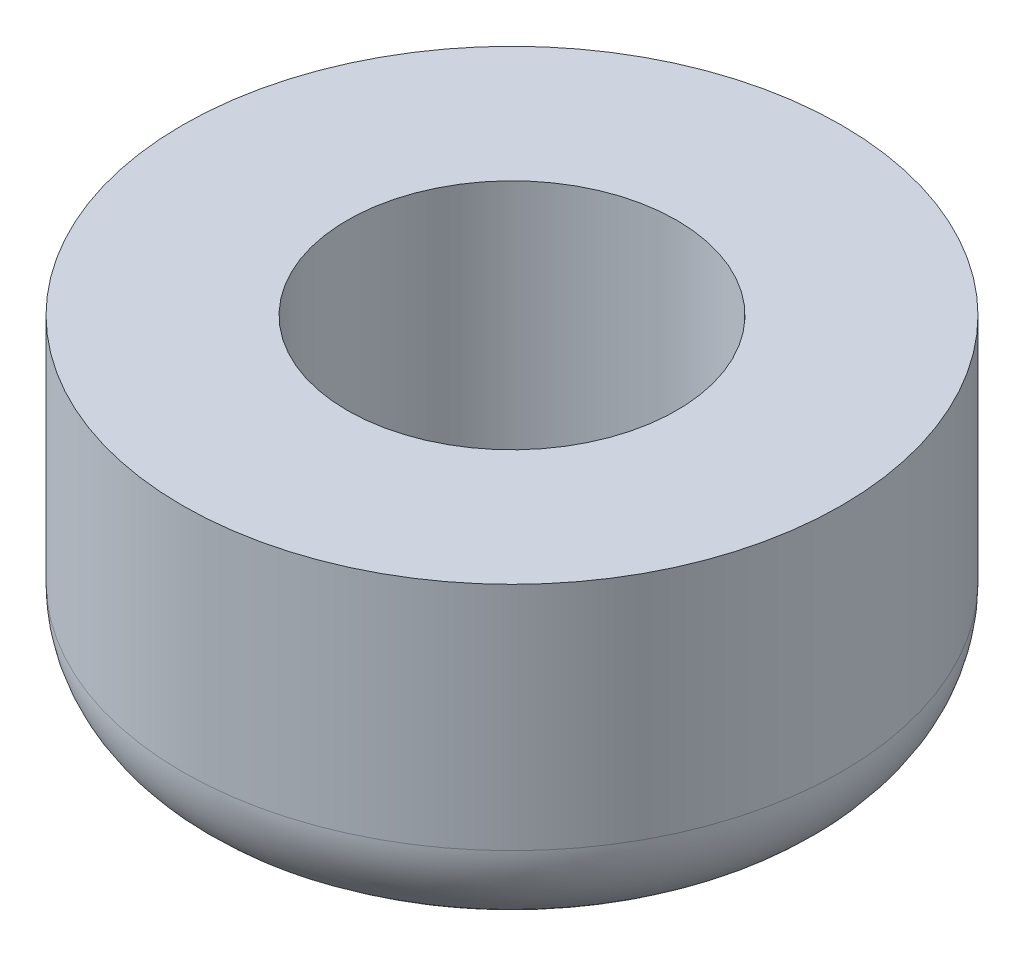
ISO-10303-21;
HEADER;
FILE_DESCRIPTION(('STEP AP214'),'2;1');
FILE_NAME('part.step','',(''),(''),'','','');
FILE_SCHEMA(('AUTOMOTIVE_DESIGN { 1 0 10303 214 1 1 1 1 }'));
ENDSEC;
DATA;
#1=APPLICATION_CONTEXT('core data for automotive mechanical design processes');
#2=APPLICATION_PROTOCOL_DEFINITION('international standard','automotive_design',2000,#1);
#3=PRODUCT_CONTEXT('',#1,'mechanical');
#4=PRODUCT('Part','Part','',(#3));
#5=PRODUCT_RELATED_PRODUCT_CATEGORY('part','',(#4));
#6=PRODUCT_DEFINITION_FORMATION('','',#4);
#7=PRODUCT_DEFINITION_CONTEXT('part definition',#1,'design');
#8=PRODUCT_DEFINITION('design','',#6,#7);
#9=PRODUCT_DEFINITION_SHAPE('','',#8);
#10=(LENGTH_UNIT() NAMED_UNIT(*) SI_UNIT(.MILLI.,.METRE.));
#11=(NAMED_UNIT(*) PLANE_ANGLE_UNIT() SI_UNIT($,.RADIAN.));
#12=(NAMED_UNIT(*) SI_UNIT($,.STERADIAN.) SOLID_ANGLE_UNIT());
#13=UNCERTAINTY_MEASURE_WITH_UNIT(LENGTH_MEASURE(1.E-05),#10,'distance_accuracy_value','');
#14=(GEOMETRIC_REPRESENTATION_CONTEXT(3) GLOBAL_UNCERTAINTY_ASSIGNED_CONTEXT((#13)) GLOBAL_UNIT_ASSIGNED_CONTEXT((#10,
#11,#12)) REPRESENTATION_CONTEXT('',''));
#15=CARTESIAN_POINT('',(0.,0.,0.));
#16=DIRECTION('',(0.,0.,1.));
#17=DIRECTION('',(1.,0.,0.));
#18=AXIS2_PLACEMENT_3D('',#15,#16,#17);
#19=CARTESIAN_POINT('',(0.,-10.,0.));
#20=DIRECTION('',(0.,1.,0.));
#21=DIRECTION('',(0.,0.,1.));
#22=AXIS2_PLACEMENT_3D('',#19,#20,#21);
#23=CYLINDRICAL_SURFACE('',#22,10.);
#24=CARTESIAN_POINT('',(0.,-7.,0.));
#25=DIRECTION('',(0.,1.,0.));
#26=DIRECTION('',(0.,0.,1.));
#27=AXIS2_PLACEMENT_3D('',#24,#25,#26);
#28=CIRCLE('',#27,10.);
#29=CARTESIAN_POINT('',(0.,-7.,10.));
#30=VERTEX_POINT('',#29);
#31=EDGE_CURVE('E38',#30,#30,#28,.T.);
#32=ORIENTED_EDGE('',*,*,#31,.T.);
#33=EDGE_LOOP('',(#32));
#34=FACE_BOUND('',#33,.T.);
#35=CARTESIAN_POINT('',(0.,0.,0.));
#36=DIRECTION('',(0.,1.,0.));
#37=DIRECTION('',(0.,0.,1.));
#38=AXIS2_PLACEMENT_3D('',#35,#36,#37);
#39=CIRCLE('',#38,10.);
#40=CARTESIAN_POINT('',(0.,0.,10.));
#41=VERTEX_POINT('',#40);
#42=EDGE_CURVE('E42',#41,#41,#39,.T.);
#43=ORIENTED_EDGE('',*,*,#42,.F.);
#44=EDGE_LOOP('',(#43));
#45=FACE_BOUND('',#44,.T.);
#46=ADVANCED_FACE('F31',(#34,#45),#23,.T.);
#47=CARTESIAN_POINT('',(0.,-10.,0.));
#48=DIRECTION('',(0.,1.,0.));
#49=DIRECTION('',(0.,0.,1.));
#50=AXIS2_PLACEMENT_3D('',#47,#48,#49);
#51=PLANE('',#50);
#52=CARTESIAN_POINT('',(0.,-10.,0.));
#53=DIRECTION('',(0.,1.,0.));
#54=DIRECTION('',(0.,0.,1.));
#55=AXIS2_PLACEMENT_3D('',#52,#53,#54);
#56=CIRCLE('',#55,7.);
#57=CARTESIAN_POINT('',(0.,-10.,7.));
#58=VERTEX_POINT('',#57);
#59=EDGE_CURVE('E10',#58,#58,#56,.F.);
#60=ORIENTED_EDGE('',*,*,#59,.T.);
#61=EDGE_LOOP('',(#60));
#62=FACE_BOUND('',#61,.T.);
#63=CARTESIAN_POINT('',(0.,-10.,0.));
#64=DIRECTION('',(0.,1.,0.));
#65=DIRECTION('',(0.,0.,1.));
#66=AXIS2_PLACEMENT_3D('',#63,#64,#65);
#67=CIRCLE('',#66,5.);
#68=CARTESIAN_POINT('',(0.,-10.,5.));
#69=VERTEX_POINT('',#68);
#70=EDGE_CURVE('E46',#69,#69,#67,.T.);
#71=ORIENTED_EDGE('',*,*,#70,.T.);
#72=EDGE_LOOP('',(#71));
#73=FACE_BOUND('',#72,.T.);
#74=ADVANCED_FACE('F55',(#62,#73),#51,.F.);
#75=CARTESIAN_POINT('',(0.,0.,0.));
#76=DIRECTION('',(0.,1.,0.));
#77=DIRECTION('',(0.,0.,1.));
#78=AXIS2_PLACEMENT_3D('',#75,#76,#77);
#79=PLANE('',#78);
#80=CARTESIAN_POINT('',(0.,0.,0.));
#81=DIRECTION('',(0.,1.,0.));
#82=DIRECTION('',(0.,0.,1.));
#83=AXIS2_PLACEMENT_3D('',#80,#81,#82);
#84=CIRCLE('',#83,5.);
#85=CARTESIAN_POINT('',(0.,0.,5.));
#86=VERTEX_POINT('',#85);
#87=EDGE_CURVE('E49',#86,#86,#84,.T.);
#88=ORIENTED_EDGE('',*,*,#87,.F.);
#89=EDGE_LOOP('',(#88));
#90=FACE_BOUND('',#89,.T.);
#91=ORIENTED_EDGE('',*,*,#42,.T.);
#92=EDGE_LOOP('',(#91));
#93=FACE_BOUND('',#92,.T.);
#94=ADVANCED_FACE('F60',(#90,#93),#79,.T.);
#95=CARTESIAN_POINT('',(0.,-10.,0.));
#96=DIRECTION('',(0.,1.,0.));
#97=DIRECTION('',(0.,0.,1.));
#98=AXIS2_PLACEMENT_3D('',#95,#96,#97);
#99=CYLINDRICAL_SURFACE('',#98,5.);
#100=ORIENTED_EDGE('',*,*,#70,.F.);
#101=EDGE_LOOP('',(#100));
#102=FACE_BOUND('',#101,.T.);
#103=ORIENTED_EDGE('',*,*,#87,.T.);
#104=EDGE_LOOP('',(#103));
#105=FACE_BOUND('',#104,.T.);
#106=ADVANCED_FACE('F57',(#102,#105),#99,.F.);
#107=CARTESIAN_POINT('',(0.,-7.,0.));
#108=DIRECTION('',(0.,1.,0.));
#109=DIRECTION('',(0.,0.,1.));
#110=AXIS2_PLACEMENT_3D('',#107,#108,#109);
#111=TOROIDAL_SURFACE('',#110,7.,3.);
#112=ORIENTED_EDGE('',*,*,#59,.F.);
#113=EDGE_LOOP('',(#112));
#114=FACE_BOUND('',#113,.T.);
#115=ORIENTED_EDGE('',*,*,#31,.F.);
#116=EDGE_LOOP('',(#115));
#117=FACE_BOUND('',#116,.T.);
#118=ADVANCED_FACE('F33',(#114,#117),#111,.T.);
#119=CLOSED_SHELL('',(#46,#74,#94,#106,#118));
#120=MANIFOLD_SOLID_BREP('B2',#119);
#121=ADVANCED_BREP_SHAPE_REPRESENTATION('',(#18,#120),#14);
#122=SHAPE_DEFINITION_REPRESENTATION(#9,#121);
ENDSEC;
END-ISO-10303-21;
